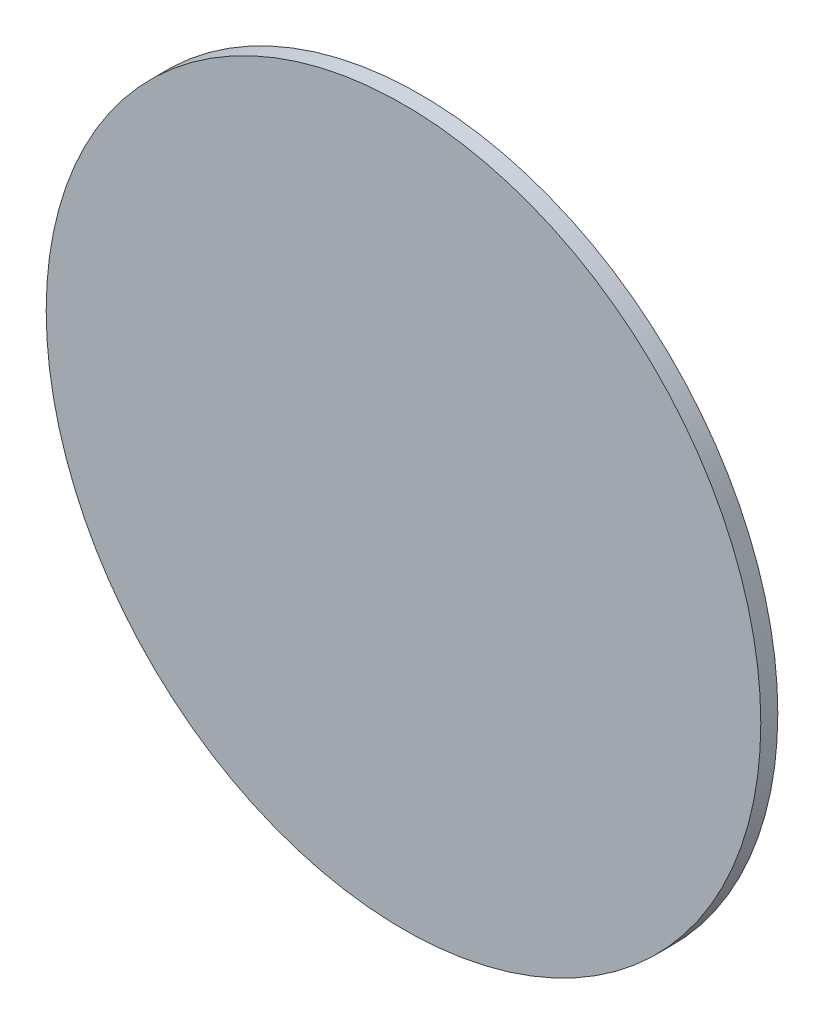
from build123d import *

# Parameters (mm, degrees)
SKETCH1_R      = 53.3466334
EXTRUDE1_DEPTH = 1.27


with BuildPart() as part:
    # Sketch1 → Extrude1 (new, symmetric)
    with BuildSketch(Plane.XY):
        Circle(SKETCH1_R)
    extrude(amount=EXTRUDE1_DEPTH, both=True)


solid = part.part
